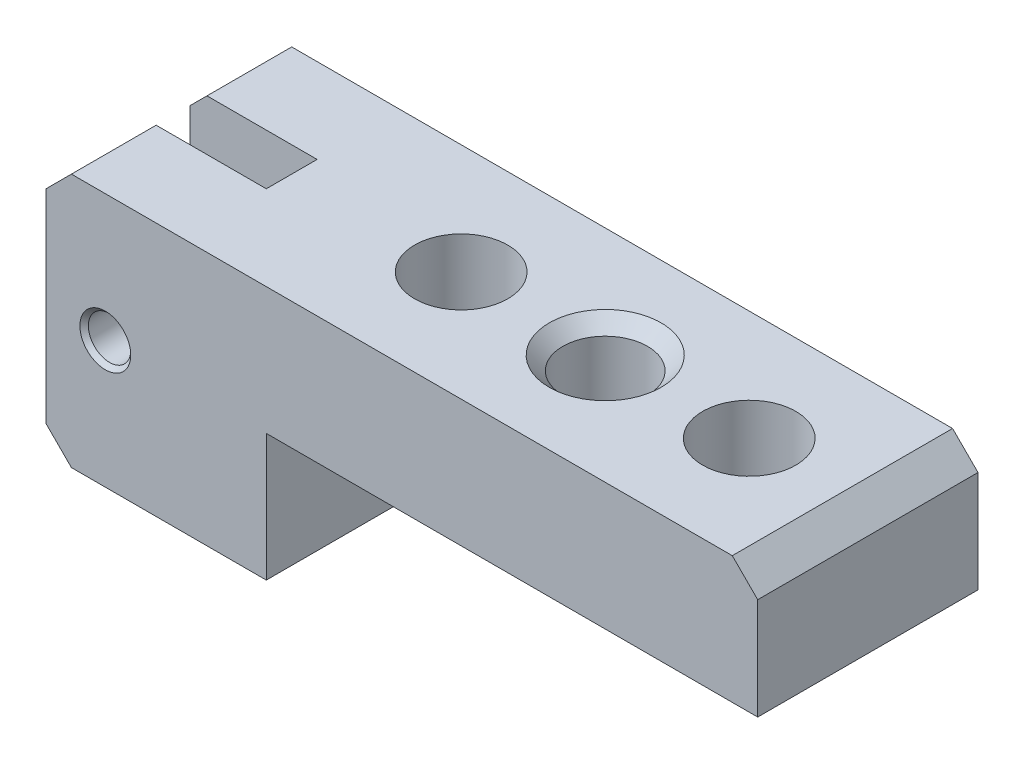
from build123d import *

# Parameters (mm, degrees)
SKETCH_1_R          = 2.5
EXTRUDE_1_DEPTH     = 26
SKETCH_2_R          = 5.5
SKETCH_2_R_2        = 5
SKETCH_2_W          = 16
SKETCH_2_H          = 6
CUT_EXTRUDE_1_DEPTH = 71.285133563
CHAMFER_1_SIZE      = 1.6
CHAMFER_2_SIZE      = 0.5
CHAMFER_3_SIZE      = 3
CHAMFER_4_SIZE      = 1


with BuildPart() as part:
    # Sketch 1 → Extrude 1 (new body)
    with BuildSketch(Plane.XY):
        Polygon((0, 0), (-26, 0), (-26, 30), (58, 30), (58, 15), (0, 15), align=None)
        with Locations((-19, 15)):
            Circle(SKETCH_1_R, mode=Mode.SUBTRACT)
    extrude(amount=-EXTRUDE_1_DEPTH)

    # Sketch 2 → Cut-Extrude 1 (cut, through all)
    with BuildSketch(Plane(origin=(0, 30, 0), x_dir=(1, 0, 0), z_dir=(0, 1, 0))):
        with Locations(Location((10, 13, 0), (0, 0, 270))):
            Circle(SKETCH_2_R)
        with Locations(Location((27, 13, 0), (0, 0, 270))):
            Circle(SKETCH_2_R_2)
        with Locations(Location((44, 13, 0), (0, 0, 270))):
            Circle(SKETCH_2_R)
        with Locations((-18, 13)):
            Rectangle(SKETCH_2_W, SKETCH_2_H)
    extrude(amount=-CUT_EXTRUDE_1_DEPTH, mode=Mode.SUBTRACT)

    # Chamfer 1
    chamfer_1_edges = [part.edges().sort_by_distance(p)[0] for p in [
        (27, 30, -18),
    ]]
    chamfer(chamfer_1_edges, length=CHAMFER_1_SIZE)

    # Chamfer 2
    chamfer_2_edges = [part.edges().sort_by_distance(p)[0] for p in [
        (-21.5, 15, -26),
        (-21.5, 15, 0),
    ]]
    chamfer(chamfer_2_edges, length=CHAMFER_2_SIZE)

    # Chamfer 3
    chamfer_3_edges = [part.edges().sort_by_distance(p)[0] for p in [
        (-26, 0, -21),
        (-26, 30, -21),
        (58, 30, -13),
        (-26, 30, -5),
        (-26, 0, -5),
    ]]
    chamfer(chamfer_3_edges, length=CHAMFER_3_SIZE)

    # Chamfer 4
    chamfer_4_edges = [part.edges().sort_by_distance(p)[0] for p in [
        (-26, 15, -10),
        (-26, 15, -16),
    ]]
    chamfer(chamfer_4_edges, length=CHAMFER_4_SIZE)


solid = part.part
